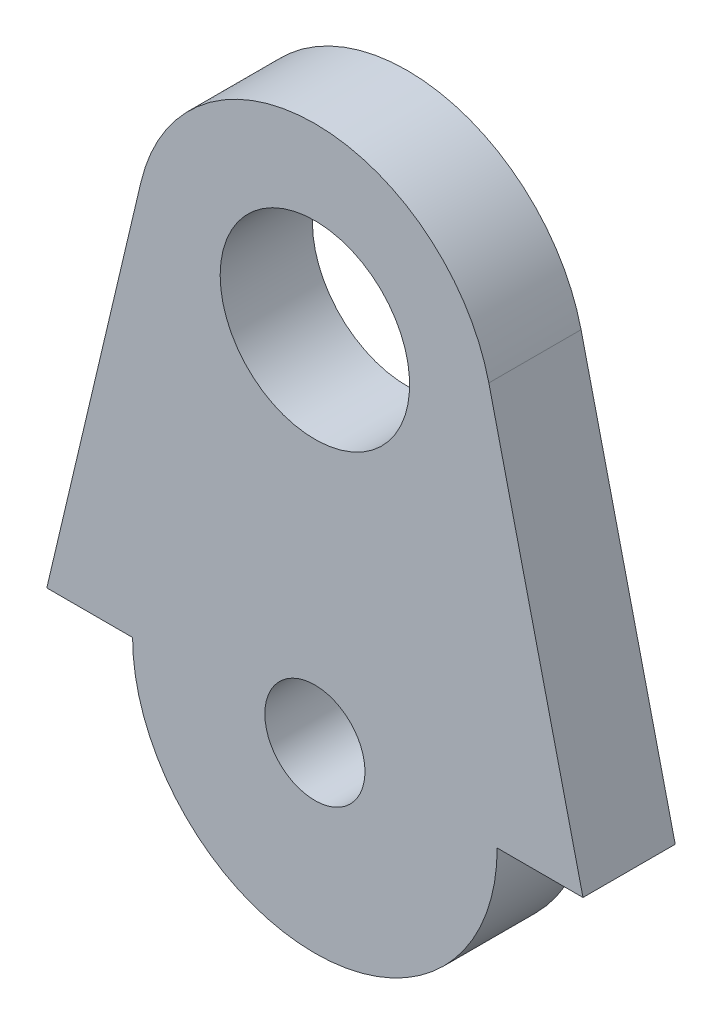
ISO-10303-21;
HEADER;
FILE_DESCRIPTION(('STEP AP214'),'2;1');
FILE_NAME('part.step','',(''),(''),'','','');
FILE_SCHEMA(('AUTOMOTIVE_DESIGN { 1 0 10303 214 1 1 1 1 }'));
ENDSEC;
DATA;
#1=APPLICATION_CONTEXT('core data for automotive mechanical design processes');
#2=APPLICATION_PROTOCOL_DEFINITION('international standard','automotive_design',2000,#1);
#3=PRODUCT_CONTEXT('',#1,'mechanical');
#4=PRODUCT('Part','Part','',(#3));
#5=PRODUCT_RELATED_PRODUCT_CATEGORY('part','',(#4));
#6=PRODUCT_DEFINITION_FORMATION('','',#4);
#7=PRODUCT_DEFINITION_CONTEXT('part definition',#1,'design');
#8=PRODUCT_DEFINITION('design','',#6,#7);
#9=PRODUCT_DEFINITION_SHAPE('','',#8);
#10=(LENGTH_UNIT() NAMED_UNIT(*) SI_UNIT(.MILLI.,.METRE.));
#11=(NAMED_UNIT(*) PLANE_ANGLE_UNIT() SI_UNIT($,.RADIAN.));
#12=(NAMED_UNIT(*) SI_UNIT($,.STERADIAN.) SOLID_ANGLE_UNIT());
#13=UNCERTAINTY_MEASURE_WITH_UNIT(LENGTH_MEASURE(1.E-05),#10,'distance_accuracy_value','');
#14=(GEOMETRIC_REPRESENTATION_CONTEXT(3) GLOBAL_UNCERTAINTY_ASSIGNED_CONTEXT((#13)) GLOBAL_UNIT_ASSIGNED_CONTEXT((#10,
#11,#12)) REPRESENTATION_CONTEXT('',''));
#15=CARTESIAN_POINT('',(0.,0.,0.));
#16=DIRECTION('',(0.,0.,1.));
#17=DIRECTION('',(1.,0.,0.));
#18=AXIS2_PLACEMENT_3D('',#15,#16,#17);
#19=CARTESIAN_POINT('',(0.,0.,1.6383));
#20=DIRECTION('',(0.,0.,1.));
#21=DIRECTION('',(1.,0.,0.));
#22=AXIS2_PLACEMENT_3D('',#19,#20,#21);
#23=PLANE('',#22);
#24=CARTESIAN_POINT('',(0.,0.,1.6383));
#25=DIRECTION('',(0.,0.,1.));
#26=DIRECTION('',(1.,0.,0.));
#27=AXIS2_PLACEMENT_3D('',#24,#25,#26);
#28=CIRCLE('',#27,1.778);
#29=CARTESIAN_POINT('',(-1.778,0.,1.6383));
#30=VERTEX_POINT('',#29);
#31=EDGE_CURVE('E124',#30,#30,#28,.T.);
#32=ORIENTED_EDGE('',*,*,#31,.F.);
#33=EDGE_LOOP('',(#32));
#34=FACE_BOUND('',#33,.T.);
#35=CARTESIAN_POINT('',(0.,0.,1.6383));
#36=DIRECTION('',(0.,0.,1.));
#37=DIRECTION('',(1.,0.,0.));
#38=AXIS2_PLACEMENT_3D('',#35,#36,#37);
#39=CIRCLE('',#38,6.477);
#40=CARTESIAN_POINT('',(-6.477,0.,1.6383));
#41=VERTEX_POINT('',#40);
#42=CARTESIAN_POINT('',(6.477,0.,1.6383));
#43=VERTEX_POINT('',#42);
#44=EDGE_CURVE('E131',#41,#43,#39,.T.);
#45=ORIENTED_EDGE('',*,*,#44,.T.);
#46=DIRECTION('',(1.,0.,0.));
#47=VECTOR('',#46,1.);
#48=CARTESIAN_POINT('',(6.477,0.,1.6383));
#49=LINE('',#48,#47);
#50=CARTESIAN_POINT('',(9.525,0.,1.6383));
#51=VERTEX_POINT('',#50);
#52=EDGE_CURVE('E89',#43,#51,#49,.T.);
#53=ORIENTED_EDGE('',*,*,#52,.T.);
#54=DIRECTION('',(-0.229909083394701,0.973212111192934,0.));
#55=VECTOR('',#54,1.);
#56=CARTESIAN_POINT('',(9.525,0.,1.6383));
#57=LINE('',#56,#55);
#58=CARTESIAN_POINT('',(6.17989690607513,14.1599226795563,1.6383));
#59=VERTEX_POINT('',#58);
#60=EDGE_CURVE('E102',#51,#59,#57,.T.);
#61=ORIENTED_EDGE('',*,*,#60,.T.);
#62=CARTESIAN_POINT('',(0.,12.7,1.6383));
#63=DIRECTION('',(0.,0.,1.));
#64=DIRECTION('',(1.,0.,0.));
#65=AXIS2_PLACEMENT_3D('',#62,#63,#64);
#66=CIRCLE('',#65,6.35);
#67=CARTESIAN_POINT('',(-6.17989690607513,14.1599226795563,1.6383));
#68=VERTEX_POINT('',#67);
#69=EDGE_CURVE('E96',#59,#68,#66,.T.);
#70=ORIENTED_EDGE('',*,*,#69,.T.);
#71=DIRECTION('',(-0.229909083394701,-0.973212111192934,0.));
#72=VECTOR('',#71,1.);
#73=CARTESIAN_POINT('',(-9.525,0.,1.6383));
#74=LINE('',#73,#72);
#75=CARTESIAN_POINT('',(-9.525,0.,1.6383));
#76=VERTEX_POINT('',#75);
#77=EDGE_CURVE('E100',#68,#76,#74,.T.);
#78=ORIENTED_EDGE('',*,*,#77,.T.);
#79=DIRECTION('',(1.,0.,0.));
#80=VECTOR('',#79,1.);
#81=CARTESIAN_POINT('',(-6.477,0.,1.6383));
#82=LINE('',#81,#80);
#83=EDGE_CURVE('E52',#76,#41,#82,.T.);
#84=ORIENTED_EDGE('',*,*,#83,.T.);
#85=EDGE_LOOP('',(#45,#53,#61,#70,#78,#84));
#86=FACE_BOUND('',#85,.T.);
#87=CARTESIAN_POINT('',(0.,12.7,1.6383));
#88=DIRECTION('',(0.,0.,1.));
#89=DIRECTION('',(1.,0.,0.));
#90=AXIS2_PLACEMENT_3D('',#87,#88,#89);
#91=CIRCLE('',#90,3.3655);
#92=CARTESIAN_POINT('',(-3.3655,12.7,1.6383));
#93=VERTEX_POINT('',#92);
#94=EDGE_CURVE('E174',#93,#93,#91,.T.);
#95=ORIENTED_EDGE('',*,*,#94,.F.);
#96=EDGE_LOOP('',(#95));
#97=FACE_BOUND('',#96,.T.);
#98=ADVANCED_FACE('F35',(#34,#86,#97),#23,.T.);
#99=CARTESIAN_POINT('',(0.,0.,-1.6383));
#100=DIRECTION('',(0.,0.,1.));
#101=DIRECTION('',(1.,0.,0.));
#102=AXIS2_PLACEMENT_3D('',#99,#100,#101);
#103=PLANE('',#102);
#104=CARTESIAN_POINT('',(0.,0.,-1.6383));
#105=DIRECTION('',(0.,0.,1.));
#106=DIRECTION('',(1.,0.,0.));
#107=AXIS2_PLACEMENT_3D('',#104,#105,#106);
#108=CIRCLE('',#107,1.778);
#109=CARTESIAN_POINT('',(-1.778,0.,-1.6383));
#110=VERTEX_POINT('',#109);
#111=EDGE_CURVE('E179',#110,#110,#108,.T.);
#112=ORIENTED_EDGE('',*,*,#111,.T.);
#113=EDGE_LOOP('',(#112));
#114=FACE_BOUND('',#113,.T.);
#115=CARTESIAN_POINT('',(0.,0.,-1.6383));
#116=DIRECTION('',(0.,0.,1.));
#117=DIRECTION('',(1.,0.,0.));
#118=AXIS2_PLACEMENT_3D('',#115,#116,#117);
#119=CIRCLE('',#118,6.477);
#120=CARTESIAN_POINT('',(-6.477,0.,-1.6383));
#121=VERTEX_POINT('',#120);
#122=CARTESIAN_POINT('',(6.477,0.,-1.6383));
#123=VERTEX_POINT('',#122);
#124=EDGE_CURVE('E120',#121,#123,#119,.T.);
#125=ORIENTED_EDGE('',*,*,#124,.F.);
#126=DIRECTION('',(1.,0.,0.));
#127=VECTOR('',#126,1.);
#128=CARTESIAN_POINT('',(-6.477,0.,-1.6383));
#129=LINE('',#128,#127);
#130=CARTESIAN_POINT('',(-9.525,0.,-1.6383));
#131=VERTEX_POINT('',#130);
#132=EDGE_CURVE('E81',#131,#121,#129,.T.);
#133=ORIENTED_EDGE('',*,*,#132,.F.);
#134=DIRECTION('',(-0.229909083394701,-0.973212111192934,0.));
#135=VECTOR('',#134,1.);
#136=CARTESIAN_POINT('',(-9.525,0.,-1.6383));
#137=LINE('',#136,#135);
#138=CARTESIAN_POINT('',(-6.17989690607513,14.1599226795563,-1.6383));
#139=VERTEX_POINT('',#138);
#140=EDGE_CURVE('E75',#139,#131,#137,.T.);
#141=ORIENTED_EDGE('',*,*,#140,.F.);
#142=CARTESIAN_POINT('',(0.,12.7,-1.6383));
#143=DIRECTION('',(0.,0.,1.));
#144=DIRECTION('',(1.,0.,0.));
#145=AXIS2_PLACEMENT_3D('',#142,#143,#144);
#146=CIRCLE('',#145,6.35);
#147=CARTESIAN_POINT('',(6.17989690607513,14.1599226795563,-1.6383));
#148=VERTEX_POINT('',#147);
#149=EDGE_CURVE('E110',#148,#139,#146,.T.);
#150=ORIENTED_EDGE('',*,*,#149,.F.);
#151=DIRECTION('',(-0.229909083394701,0.973212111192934,0.));
#152=VECTOR('',#151,1.);
#153=CARTESIAN_POINT('',(9.525,0.,-1.6383));
#154=LINE('',#153,#152);
#155=CARTESIAN_POINT('',(9.525,0.,-1.6383));
#156=VERTEX_POINT('',#155);
#157=EDGE_CURVE('E126',#156,#148,#154,.T.);
#158=ORIENTED_EDGE('',*,*,#157,.F.);
#159=DIRECTION('',(1.,0.,0.));
#160=VECTOR('',#159,1.);
#161=CARTESIAN_POINT('',(6.477,0.,-1.6383));
#162=LINE('',#161,#160);
#163=EDGE_CURVE('E123',#123,#156,#162,.T.);
#164=ORIENTED_EDGE('',*,*,#163,.F.);
#165=EDGE_LOOP('',(#125,#133,#141,#150,#158,#164));
#166=FACE_BOUND('',#165,.T.);
#167=CARTESIAN_POINT('',(0.,12.7,-1.6383));
#168=DIRECTION('',(0.,0.,1.));
#169=DIRECTION('',(1.,0.,0.));
#170=AXIS2_PLACEMENT_3D('',#167,#168,#169);
#171=CIRCLE('',#170,3.3655);
#172=CARTESIAN_POINT('',(-3.3655,12.7,-1.6383));
#173=VERTEX_POINT('',#172);
#174=EDGE_CURVE('E177',#173,#173,#171,.T.);
#175=ORIENTED_EDGE('',*,*,#174,.T.);
#176=EDGE_LOOP('',(#175));
#177=FACE_BOUND('',#176,.T.);
#178=ADVANCED_FACE('F140',(#114,#166,#177),#103,.F.);
#179=CARTESIAN_POINT('',(0.,0.,1.6383));
#180=DIRECTION('',(0.,0.,-1.));
#181=DIRECTION('',(-1.,0.,0.));
#182=AXIS2_PLACEMENT_3D('',#179,#180,#181);
#183=CYLINDRICAL_SURFACE('',#182,6.477);
#184=ORIENTED_EDGE('',*,*,#124,.T.);
#185=DIRECTION('',(0.,0.,-1.));
#186=VECTOR('',#185,1.);
#187=CARTESIAN_POINT('',(6.477,0.,1.6383));
#188=LINE('',#187,#186);
#189=EDGE_CURVE('E11',#43,#123,#188,.T.);
#190=ORIENTED_EDGE('',*,*,#189,.F.);
#191=ORIENTED_EDGE('',*,*,#44,.F.);
#192=DIRECTION('',(0.,0.,-1.));
#193=VECTOR('',#192,1.);
#194=CARTESIAN_POINT('',(-6.477,0.,1.6383));
#195=LINE('',#194,#193);
#196=EDGE_CURVE('E116',#41,#121,#195,.T.);
#197=ORIENTED_EDGE('',*,*,#196,.T.);
#198=EDGE_LOOP('',(#184,#190,#191,#197));
#199=FACE_BOUND('',#198,.T.);
#200=ADVANCED_FACE('F37',(#199),#183,.T.);
#201=CARTESIAN_POINT('',(6.477,0.,1.6383));
#202=DIRECTION('',(0.,1.,0.));
#203=DIRECTION('',(-1.,0.,0.));
#204=AXIS2_PLACEMENT_3D('',#201,#202,#203);
#205=PLANE('',#204);
#206=ORIENTED_EDGE('',*,*,#163,.T.);
#207=DIRECTION('',(0.,0.,-1.));
#208=VECTOR('',#207,1.);
#209=CARTESIAN_POINT('',(9.525,0.,1.6383));
#210=LINE('',#209,#208);
#211=EDGE_CURVE('E44',#51,#156,#210,.T.);
#212=ORIENTED_EDGE('',*,*,#211,.F.);
#213=ORIENTED_EDGE('',*,*,#52,.F.);
#214=ORIENTED_EDGE('',*,*,#189,.T.);
#215=EDGE_LOOP('',(#206,#212,#213,#214));
#216=FACE_BOUND('',#215,.T.);
#217=ADVANCED_FACE('F220',(#216),#205,.F.);
#218=CARTESIAN_POINT('',(9.525,0.,1.6383));
#219=DIRECTION('',(-0.973212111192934,-0.229909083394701,0.));
#220=DIRECTION('',(0.229909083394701,-0.973212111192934,0.));
#221=AXIS2_PLACEMENT_3D('',#218,#219,#220);
#222=PLANE('',#221);
#223=ORIENTED_EDGE('',*,*,#157,.T.);
#224=DIRECTION('',(0.,0.,-1.));
#225=VECTOR('',#224,1.);
#226=CARTESIAN_POINT('',(6.17989690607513,14.1599226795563,1.6383));
#227=LINE('',#226,#225);
#228=EDGE_CURVE('E111',#59,#148,#227,.T.);
#229=ORIENTED_EDGE('',*,*,#228,.F.);
#230=ORIENTED_EDGE('',*,*,#60,.F.);
#231=ORIENTED_EDGE('',*,*,#211,.T.);
#232=EDGE_LOOP('',(#223,#229,#230,#231));
#233=FACE_BOUND('',#232,.T.);
#234=ADVANCED_FACE('F137',(#233),#222,.F.);
#235=CARTESIAN_POINT('',(0.,12.7,1.6383));
#236=DIRECTION('',(0.,0.,-1.));
#237=DIRECTION('',(-1.,0.,0.));
#238=AXIS2_PLACEMENT_3D('',#235,#236,#237);
#239=CYLINDRICAL_SURFACE('',#238,6.35);
#240=ORIENTED_EDGE('',*,*,#149,.T.);
#241=DIRECTION('',(0.,0.,-1.));
#242=VECTOR('',#241,1.);
#243=CARTESIAN_POINT('',(-6.17989690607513,14.1599226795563,1.6383));
#244=LINE('',#243,#242);
#245=EDGE_CURVE('E107',#68,#139,#244,.T.);
#246=ORIENTED_EDGE('',*,*,#245,.F.);
#247=ORIENTED_EDGE('',*,*,#69,.F.);
#248=ORIENTED_EDGE('',*,*,#228,.T.);
#249=EDGE_LOOP('',(#240,#246,#247,#248));
#250=FACE_BOUND('',#249,.T.);
#251=ADVANCED_FACE('F108',(#250),#239,.T.);
#252=CARTESIAN_POINT('',(-9.525,0.,1.6383));
#253=DIRECTION('',(0.973212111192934,-0.229909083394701,0.));
#254=DIRECTION('',(0.229909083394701,0.973212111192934,0.));
#255=AXIS2_PLACEMENT_3D('',#252,#253,#254);
#256=PLANE('',#255);
#257=ORIENTED_EDGE('',*,*,#140,.T.);
#258=DIRECTION('',(0.,0.,-1.));
#259=VECTOR('',#258,1.);
#260=CARTESIAN_POINT('',(-9.525,0.,1.6383));
#261=LINE('',#260,#259);
#262=EDGE_CURVE('E112',#76,#131,#261,.T.);
#263=ORIENTED_EDGE('',*,*,#262,.F.);
#264=ORIENTED_EDGE('',*,*,#77,.F.);
#265=ORIENTED_EDGE('',*,*,#245,.T.);
#266=EDGE_LOOP('',(#257,#263,#264,#265));
#267=FACE_BOUND('',#266,.T.);
#268=ADVANCED_FACE('F114',(#267),#256,.F.);
#269=CARTESIAN_POINT('',(-6.477,0.,1.6383));
#270=DIRECTION('',(0.,1.,0.));
#271=DIRECTION('',(-1.,0.,0.));
#272=AXIS2_PLACEMENT_3D('',#269,#270,#271);
#273=PLANE('',#272);
#274=ORIENTED_EDGE('',*,*,#132,.T.);
#275=ORIENTED_EDGE('',*,*,#196,.F.);
#276=ORIENTED_EDGE('',*,*,#83,.F.);
#277=ORIENTED_EDGE('',*,*,#262,.T.);
#278=EDGE_LOOP('',(#274,#275,#276,#277));
#279=FACE_BOUND('',#278,.T.);
#280=ADVANCED_FACE('F145',(#279),#273,.F.);
#281=CARTESIAN_POINT('',(0.,0.,1.6383));
#282=DIRECTION('',(0.,0.,-1.));
#283=DIRECTION('',(-1.,0.,0.));
#284=AXIS2_PLACEMENT_3D('',#281,#282,#283);
#285=CYLINDRICAL_SURFACE('',#284,1.778);
#286=CARTESIAN_POINT('',(-1.778,0.,1.6383));
#287=CARTESIAN_POINT('',(-1.778,0.,1.60416875));
#288=CARTESIAN_POINT('',(-1.778,0.,1.5700375));
#289=CARTESIAN_POINT('',(-1.778,0.,1.501775));
#290=CARTESIAN_POINT('',(-1.778,0.,1.46764375));
#291=CARTESIAN_POINT('',(-1.778,0.,1.39938125));
#292=CARTESIAN_POINT('',(-1.778,0.,1.36525));
#293=CARTESIAN_POINT('',(-1.778,0.,1.2969875));
#294=CARTESIAN_POINT('',(-1.778,0.,1.26285625));
#295=CARTESIAN_POINT('',(-1.778,0.,1.19459375));
#296=CARTESIAN_POINT('',(-1.778,0.,1.1604625));
#297=CARTESIAN_POINT('',(-1.778,0.,1.0922));
#298=CARTESIAN_POINT('',(-1.778,0.,1.05806875));
#299=CARTESIAN_POINT('',(-1.778,0.,0.98980625));
#300=CARTESIAN_POINT('',(-1.778,0.,0.955675));
#301=CARTESIAN_POINT('',(-1.778,0.,0.8874125));
#302=CARTESIAN_POINT('',(-1.778,0.,0.85328125));
#303=CARTESIAN_POINT('',(-1.778,0.,0.78501875));
#304=CARTESIAN_POINT('',(-1.778,0.,0.7508875));
#305=CARTESIAN_POINT('',(-1.778,0.,0.682625));
#306=CARTESIAN_POINT('',(-1.778,0.,0.64849375));
#307=CARTESIAN_POINT('',(-1.778,0.,0.58023125));
#308=CARTESIAN_POINT('',(-1.778,0.,0.5461));
#309=CARTESIAN_POINT('',(-1.778,0.,0.4778375));
#310=CARTESIAN_POINT('',(-1.778,0.,0.44370625));
#311=CARTESIAN_POINT('',(-1.778,0.,0.37544375));
#312=CARTESIAN_POINT('',(-1.778,0.,0.3413125));
#313=CARTESIAN_POINT('',(-1.778,0.,0.27305));
#314=CARTESIAN_POINT('',(-1.778,0.,0.23891875));
#315=CARTESIAN_POINT('',(-1.778,0.,0.17065625));
#316=CARTESIAN_POINT('',(-1.778,0.,0.136525));
#317=CARTESIAN_POINT('',(-1.778,0.,0.0682624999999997));
#318=CARTESIAN_POINT('',(-1.778,0.,0.0341312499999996));
#319=CARTESIAN_POINT('',(-1.778,0.,-0.0341312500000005));
#320=CARTESIAN_POINT('',(-1.778,0.,-0.0682625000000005));
#321=CARTESIAN_POINT('',(-1.778,0.,-0.136525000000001));
#322=CARTESIAN_POINT('',(-1.778,0.,-0.170656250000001));
#323=CARTESIAN_POINT('',(-1.778,0.,-0.23891875));
#324=CARTESIAN_POINT('',(-1.778,0.,-0.27305));
#325=CARTESIAN_POINT('',(-1.778,0.,-0.3413125));
#326=CARTESIAN_POINT('',(-1.778,0.,-0.37544375));
#327=CARTESIAN_POINT('',(-1.778,0.,-0.44370625));
#328=CARTESIAN_POINT('',(-1.778,0.,-0.4778375));
#329=CARTESIAN_POINT('',(-1.778,0.,-0.5461));
#330=CARTESIAN_POINT('',(-1.778,0.,-0.58023125));
#331=CARTESIAN_POINT('',(-1.778,0.,-0.64849375));
#332=CARTESIAN_POINT('',(-1.778,0.,-0.682625));
#333=CARTESIAN_POINT('',(-1.778,0.,-0.7508875));
#334=CARTESIAN_POINT('',(-1.778,0.,-0.78501875));
#335=CARTESIAN_POINT('',(-1.778,0.,-0.85328125));
#336=CARTESIAN_POINT('',(-1.778,0.,-0.8874125));
#337=CARTESIAN_POINT('',(-1.778,0.,-0.955675));
#338=CARTESIAN_POINT('',(-1.778,0.,-0.98980625));
#339=CARTESIAN_POINT('',(-1.778,0.,-1.05806875));
#340=CARTESIAN_POINT('',(-1.778,0.,-1.0922));
#341=CARTESIAN_POINT('',(-1.778,0.,-1.1604625));
#342=CARTESIAN_POINT('',(-1.778,0.,-1.19459375));
#343=CARTESIAN_POINT('',(-1.778,0.,-1.26285625));
#344=CARTESIAN_POINT('',(-1.778,0.,-1.2969875));
#345=CARTESIAN_POINT('',(-1.778,0.,-1.36525));
#346=CARTESIAN_POINT('',(-1.778,0.,-1.39938125));
#347=CARTESIAN_POINT('',(-1.778,0.,-1.46764375));
#348=CARTESIAN_POINT('',(-1.778,0.,-1.501775));
#349=CARTESIAN_POINT('',(-1.778,0.,-1.5700375));
#350=CARTESIAN_POINT('',(-1.778,0.,-1.60416875));
#351=CARTESIAN_POINT('',(-1.778,0.,-1.6383));
#352=B_SPLINE_CURVE_WITH_KNOTS('',3,(#286,#287,#288,#289,#290,#291,#292,#293,#294,#295,#296,
#297,#298,#299,#300,#301,#302,#303,#304,#305,#306,#307,#308,#309,#310,#311,#312,#313,#314,#315,
#316,#317,#318,#319,#320,#321,#322,#323,#324,#325,#326,#327,#328,#329,#330,#331,#332,#333,#334,
#335,#336,#337,#338,#339,#340,#341,#342,#343,#344,#345,#346,#347,#348,#349,#350,#351),
.UNSPECIFIED.,.F.,.F.,(4,2,2,2,2,2,2,2,2,2,2,2,2,2,2,2,2,2,2,2,2,2,2,2,2,2,2,2,2,2,2,2,4),(0.,
0.10239375,0.2047875,0.30718125,0.409575,0.51196875,0.6143625,0.71675625,0.81915,0.92154375,
1.0239375,1.12633125,1.228725,1.33111875,1.4335125,1.53590625,1.6383,1.74069375,1.8430875,
1.94548125,2.047875,2.15026875,2.2526625,2.35505625,2.45745,2.55984375,2.6622375,2.76463125,
2.867025,2.96941875,3.0718125,3.17420625,3.2766),.UNSPECIFIED.);
#353=EDGE_CURVE('BSEAM147',#30,#110,#352,.T.);
#354=ORIENTED_EDGE('',*,*,#31,.T.);
#355=ORIENTED_EDGE('',*,*,#111,.F.);
#356=ORIENTED_EDGE('',*,*,#353,.T.);
#357=ORIENTED_EDGE('',*,*,#353,.F.);
#358=EDGE_LOOP('',(#354,#356,#355,#357));
#359=FACE_BOUND('',#358,.T.);
#360=ADVANCED_FACE('F147',(#359),#285,.F.);
#361=CARTESIAN_POINT('',(0.,12.7,1.6383));
#362=DIRECTION('',(0.,0.,-1.));
#363=DIRECTION('',(-1.,0.,0.));
#364=AXIS2_PLACEMENT_3D('',#361,#362,#363);
#365=CYLINDRICAL_SURFACE('',#364,3.3655);
#366=CARTESIAN_POINT('',(-3.3655,12.7,1.6383));
#367=CARTESIAN_POINT('',(-3.3655,12.7,1.60416875));
#368=CARTESIAN_POINT('',(-3.3655,12.7,1.5700375));
#369=CARTESIAN_POINT('',(-3.3655,12.7,1.501775));
#370=CARTESIAN_POINT('',(-3.3655,12.7,1.46764375));
#371=CARTESIAN_POINT('',(-3.3655,12.7,1.39938125));
#372=CARTESIAN_POINT('',(-3.3655,12.7,1.36525));
#373=CARTESIAN_POINT('',(-3.3655,12.7,1.2969875));
#374=CARTESIAN_POINT('',(-3.3655,12.7,1.26285625));
#375=CARTESIAN_POINT('',(-3.3655,12.7,1.19459375));
#376=CARTESIAN_POINT('',(-3.3655,12.7,1.1604625));
#377=CARTESIAN_POINT('',(-3.3655,12.7,1.0922));
#378=CARTESIAN_POINT('',(-3.3655,12.7,1.05806875));
#379=CARTESIAN_POINT('',(-3.3655,12.7,0.98980625));
#380=CARTESIAN_POINT('',(-3.3655,12.7,0.955675));
#381=CARTESIAN_POINT('',(-3.3655,12.7,0.8874125));
#382=CARTESIAN_POINT('',(-3.3655,12.7,0.85328125));
#383=CARTESIAN_POINT('',(-3.3655,12.7,0.78501875));
#384=CARTESIAN_POINT('',(-3.3655,12.7,0.7508875));
#385=CARTESIAN_POINT('',(-3.3655,12.7,0.682625));
#386=CARTESIAN_POINT('',(-3.3655,12.7,0.64849375));
#387=CARTESIAN_POINT('',(-3.3655,12.7,0.58023125));
#388=CARTESIAN_POINT('',(-3.3655,12.7,0.5461));
#389=CARTESIAN_POINT('',(-3.3655,12.7,0.4778375));
#390=CARTESIAN_POINT('',(-3.3655,12.7,0.44370625));
#391=CARTESIAN_POINT('',(-3.3655,12.7,0.37544375));
#392=CARTESIAN_POINT('',(-3.3655,12.7,0.3413125));
#393=CARTESIAN_POINT('',(-3.3655,12.7,0.27305));
#394=CARTESIAN_POINT('',(-3.3655,12.7,0.23891875));
#395=CARTESIAN_POINT('',(-3.3655,12.7,0.17065625));
#396=CARTESIAN_POINT('',(-3.3655,12.7,0.136525));
#397=CARTESIAN_POINT('',(-3.3655,12.7,0.0682624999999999));
#398=CARTESIAN_POINT('',(-3.3655,12.7,0.0341312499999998));
#399=CARTESIAN_POINT('',(-3.3655,12.7,-0.0341312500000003));
#400=CARTESIAN_POINT('',(-3.3655,12.7,-0.0682625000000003));
#401=CARTESIAN_POINT('',(-3.3655,12.7,-0.136525));
#402=CARTESIAN_POINT('',(-3.3655,12.7,-0.17065625));
#403=CARTESIAN_POINT('',(-3.3655,12.7,-0.23891875));
#404=CARTESIAN_POINT('',(-3.3655,12.7,-0.27305));
#405=CARTESIAN_POINT('',(-3.3655,12.7,-0.3413125));
#406=CARTESIAN_POINT('',(-3.3655,12.7,-0.37544375));
#407=CARTESIAN_POINT('',(-3.3655,12.7,-0.44370625));
#408=CARTESIAN_POINT('',(-3.3655,12.7,-0.4778375));
#409=CARTESIAN_POINT('',(-3.3655,12.7,-0.5461));
#410=CARTESIAN_POINT('',(-3.3655,12.7,-0.58023125));
#411=CARTESIAN_POINT('',(-3.3655,12.7,-0.64849375));
#412=CARTESIAN_POINT('',(-3.3655,12.7,-0.682625));
#413=CARTESIAN_POINT('',(-3.3655,12.7,-0.7508875));
#414=CARTESIAN_POINT('',(-3.3655,12.7,-0.78501875));
#415=CARTESIAN_POINT('',(-3.3655,12.7,-0.85328125));
#416=CARTESIAN_POINT('',(-3.3655,12.7,-0.8874125));
#417=CARTESIAN_POINT('',(-3.3655,12.7,-0.955675));
#418=CARTESIAN_POINT('',(-3.3655,12.7,-0.98980625));
#419=CARTESIAN_POINT('',(-3.3655,12.7,-1.05806875));
#420=CARTESIAN_POINT('',(-3.3655,12.7,-1.0922));
#421=CARTESIAN_POINT('',(-3.3655,12.7,-1.1604625));
#422=CARTESIAN_POINT('',(-3.3655,12.7,-1.19459375));
#423=CARTESIAN_POINT('',(-3.3655,12.7,-1.26285625));
#424=CARTESIAN_POINT('',(-3.3655,12.7,-1.2969875));
#425=CARTESIAN_POINT('',(-3.3655,12.7,-1.36525));
#426=CARTESIAN_POINT('',(-3.3655,12.7,-1.39938125));
#427=CARTESIAN_POINT('',(-3.3655,12.7,-1.46764375));
#428=CARTESIAN_POINT('',(-3.3655,12.7,-1.501775));
#429=CARTESIAN_POINT('',(-3.3655,12.7,-1.5700375));
#430=CARTESIAN_POINT('',(-3.3655,12.7,-1.60416875));
#431=CARTESIAN_POINT('',(-3.3655,12.7,-1.6383));
#432=B_SPLINE_CURVE_WITH_KNOTS('',3,(#366,#367,#368,#369,#370,#371,#372,#373,#374,#375,#376,
#377,#378,#379,#380,#381,#382,#383,#384,#385,#386,#387,#388,#389,#390,#391,#392,#393,#394,#395,
#396,#397,#398,#399,#400,#401,#402,#403,#404,#405,#406,#407,#408,#409,#410,#411,#412,#413,#414,
#415,#416,#417,#418,#419,#420,#421,#422,#423,#424,#425,#426,#427,#428,#429,#430,#431),
.UNSPECIFIED.,.F.,.F.,(4,2,2,2,2,2,2,2,2,2,2,2,2,2,2,2,2,2,2,2,2,2,2,2,2,2,2,2,2,2,2,2,4),(0.,
0.10239375,0.2047875,0.30718125,0.409575,0.51196875,0.6143625,0.71675625,0.81915,0.92154375,
1.0239375,1.12633125,1.228725,1.33111875,1.4335125,1.53590625,1.6383,1.74069375,1.8430875,
1.94548125,2.047875,2.15026875,2.2526625,2.35505625,2.45745,2.55984375,2.6622375,2.76463125,
2.867025,2.96941875,3.0718125,3.17420625,3.2766),.UNSPECIFIED.);
#433=EDGE_CURVE('BSEAM153',#93,#173,#432,.T.);
#434=ORIENTED_EDGE('',*,*,#94,.T.);
#435=ORIENTED_EDGE('',*,*,#174,.F.);
#436=ORIENTED_EDGE('',*,*,#433,.T.);
#437=ORIENTED_EDGE('',*,*,#433,.F.);
#438=EDGE_LOOP('',(#434,#436,#435,#437));
#439=FACE_BOUND('',#438,.T.);
#440=ADVANCED_FACE('F153',(#439),#365,.F.);
#441=CLOSED_SHELL('',(#98,#178,#200,#217,#234,#251,#268,#280,#360,#440));
#442=MANIFOLD_SOLID_BREP('B2',#441);
#443=ADVANCED_BREP_SHAPE_REPRESENTATION('',(#18,#442),#14);
#444=SHAPE_DEFINITION_REPRESENTATION(#9,#443);
ENDSEC;
END-ISO-10303-21;
